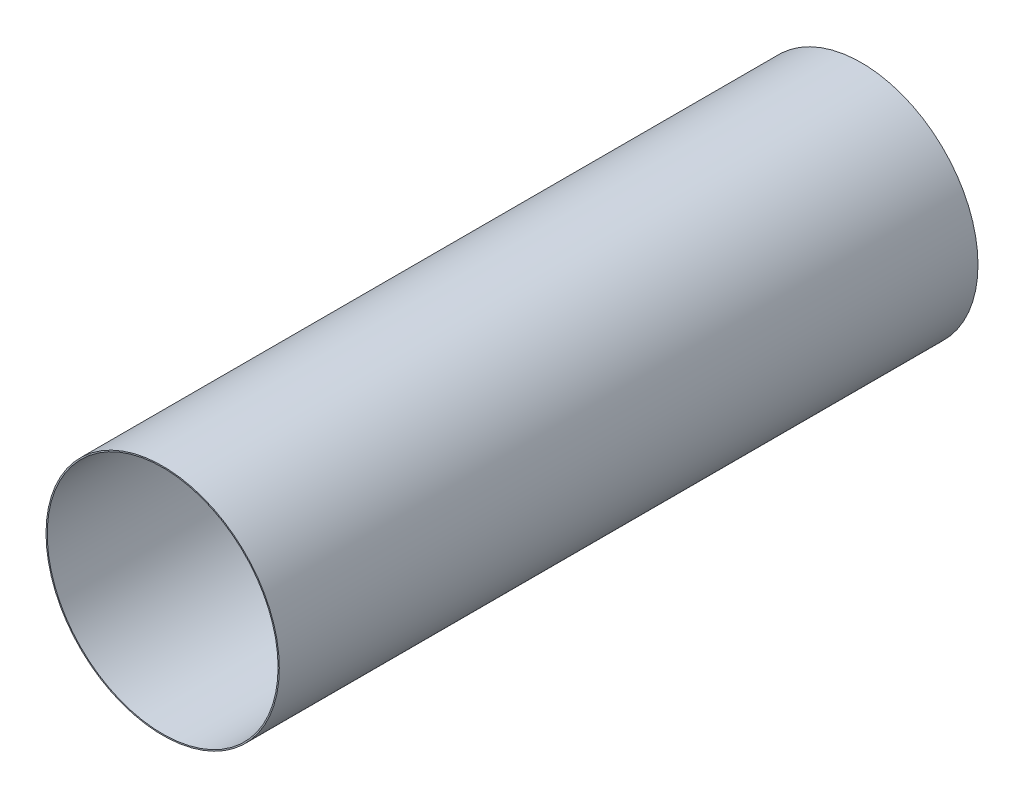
from build123d import *

# Parameters (mm, degrees)
SKETCH1_R           = 19.2
SKETCH1_R_2         = 19
BOSS_EXTRUDE1_DEPTH = 115


with BuildPart() as part:
    # Sketch1 → Boss-Extrude1 (new body)
    with BuildSketch(Plane.XY):
        Circle(SKETCH1_R)
        Circle(SKETCH1_R_2, mode=Mode.SUBTRACT)
    extrude(amount=-BOSS_EXTRUDE1_DEPTH)


solid = part.part
